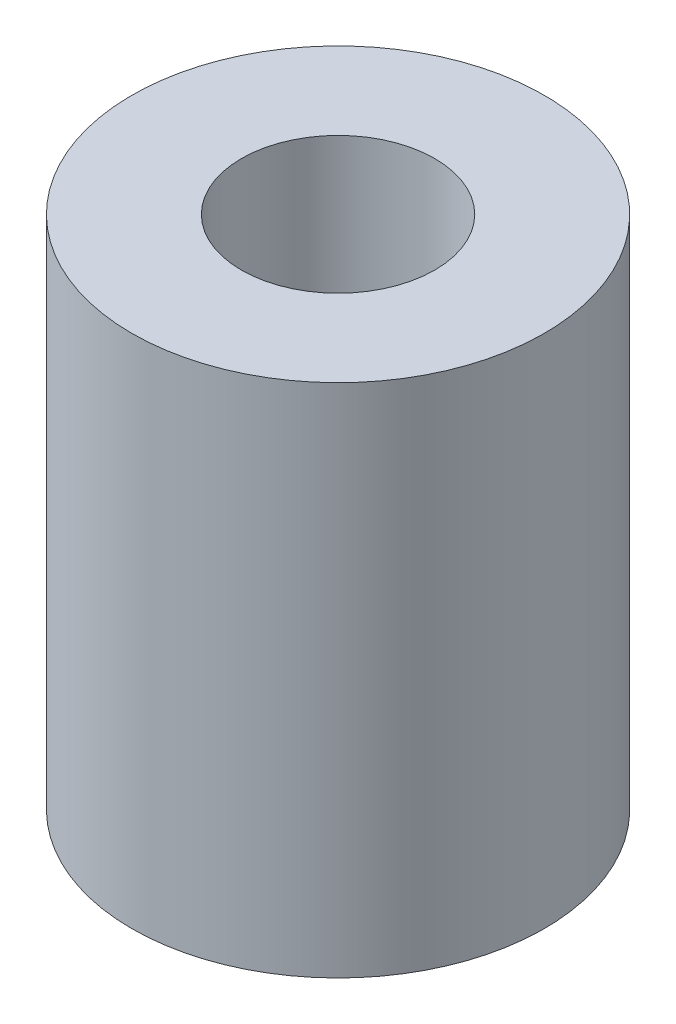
ISO-10303-21;
HEADER;
FILE_DESCRIPTION(('STEP AP214'),'2;1');
FILE_NAME('part.step','',(''),(''),'','','');
FILE_SCHEMA(('AUTOMOTIVE_DESIGN { 1 0 10303 214 1 1 1 1 }'));
ENDSEC;
DATA;
#1=APPLICATION_CONTEXT('core data for automotive mechanical design processes');
#2=APPLICATION_PROTOCOL_DEFINITION('international standard','automotive_design',2000,#1);
#3=PRODUCT_CONTEXT('',#1,'mechanical');
#4=PRODUCT('Part','Part','',(#3));
#5=PRODUCT_RELATED_PRODUCT_CATEGORY('part','',(#4));
#6=PRODUCT_DEFINITION_FORMATION('','',#4);
#7=PRODUCT_DEFINITION_CONTEXT('part definition',#1,'design');
#8=PRODUCT_DEFINITION('design','',#6,#7);
#9=PRODUCT_DEFINITION_SHAPE('','',#8);
#10=(LENGTH_UNIT() NAMED_UNIT(*) SI_UNIT(.MILLI.,.METRE.));
#11=(NAMED_UNIT(*) PLANE_ANGLE_UNIT() SI_UNIT($,.RADIAN.));
#12=(NAMED_UNIT(*) SI_UNIT($,.STERADIAN.) SOLID_ANGLE_UNIT());
#13=UNCERTAINTY_MEASURE_WITH_UNIT(LENGTH_MEASURE(1.E-05),#10,'distance_accuracy_value','');
#14=(GEOMETRIC_REPRESENTATION_CONTEXT(3) GLOBAL_UNCERTAINTY_ASSIGNED_CONTEXT((#13)) GLOBAL_UNIT_ASSIGNED_CONTEXT((#10,
#11,#12)) REPRESENTATION_CONTEXT('',''));
#15=CARTESIAN_POINT('',(0.,0.,0.));
#16=DIRECTION('',(0.,0.,1.));
#17=DIRECTION('',(1.,0.,0.));
#18=AXIS2_PLACEMENT_3D('',#15,#16,#17);
#19=CARTESIAN_POINT('',(0.,12.7,0.));
#20=DIRECTION('',(0.,1.,0.));
#21=DIRECTION('',(0.,0.,1.));
#22=AXIS2_PLACEMENT_3D('',#19,#20,#21);
#23=PLANE('',#22);
#24=CARTESIAN_POINT('',(0.,12.7,0.));
#25=DIRECTION('',(0.,1.,0.));
#26=DIRECTION('',(0.,0.,1.));
#27=AXIS2_PLACEMENT_3D('',#24,#25,#26);
#28=CIRCLE('',#27,5.08);
#29=CARTESIAN_POINT('',(0.,12.7,5.08));
#30=VERTEX_POINT('',#29);
#31=EDGE_CURVE('E10',#30,#30,#28,.T.);
#32=ORIENTED_EDGE('',*,*,#31,.T.);
#33=EDGE_LOOP('',(#32));
#34=FACE_BOUND('',#33,.T.);
#35=CARTESIAN_POINT('',(0.,12.7,0.));
#36=DIRECTION('',(0.,1.,0.));
#37=DIRECTION('',(0.,0.,1.));
#38=AXIS2_PLACEMENT_3D('',#35,#36,#37);
#39=CIRCLE('',#38,2.38125);
#40=CARTESIAN_POINT('',(0.,12.7,2.38125));
#41=VERTEX_POINT('',#40);
#42=EDGE_CURVE('E42',#41,#41,#39,.T.);
#43=ORIENTED_EDGE('',*,*,#42,.F.);
#44=EDGE_LOOP('',(#43));
#45=FACE_BOUND('',#44,.T.);
#46=ADVANCED_FACE('F31',(#34,#45),#23,.T.);
#47=CARTESIAN_POINT('',(0.,0.,0.));
#48=DIRECTION('',(0.,1.,0.));
#49=DIRECTION('',(0.,0.,1.));
#50=AXIS2_PLACEMENT_3D('',#47,#48,#49);
#51=PLANE('',#50);
#52=CARTESIAN_POINT('',(0.,0.,0.));
#53=DIRECTION('',(0.,1.,0.));
#54=DIRECTION('',(0.,0.,1.));
#55=AXIS2_PLACEMENT_3D('',#52,#53,#54);
#56=CIRCLE('',#55,5.08);
#57=CARTESIAN_POINT('',(0.,0.,5.08));
#58=VERTEX_POINT('',#57);
#59=EDGE_CURVE('E35',#58,#58,#56,.T.);
#60=ORIENTED_EDGE('',*,*,#59,.F.);
#61=EDGE_LOOP('',(#60));
#62=FACE_BOUND('',#61,.T.);
#63=CARTESIAN_POINT('',(0.,0.,0.));
#64=DIRECTION('',(0.,1.,0.));
#65=DIRECTION('',(0.,0.,1.));
#66=AXIS2_PLACEMENT_3D('',#63,#64,#65);
#67=CIRCLE('',#66,2.38125);
#68=CARTESIAN_POINT('',(0.,0.,2.38125));
#69=VERTEX_POINT('',#68);
#70=EDGE_CURVE('E44',#69,#69,#67,.T.);
#71=ORIENTED_EDGE('',*,*,#70,.T.);
#72=EDGE_LOOP('',(#71));
#73=FACE_BOUND('',#72,.T.);
#74=ADVANCED_FACE('F54',(#62,#73),#51,.F.);
#75=CARTESIAN_POINT('',(0.,12.7,0.));
#76=DIRECTION('',(0.,-1.,0.));
#77=DIRECTION('',(0.,0.,-1.));
#78=AXIS2_PLACEMENT_3D('',#75,#76,#77);
#79=CYLINDRICAL_SURFACE('',#78,5.08);
#80=ORIENTED_EDGE('',*,*,#31,.F.);
#81=EDGE_LOOP('',(#80));
#82=FACE_BOUND('',#81,.T.);
#83=ORIENTED_EDGE('',*,*,#59,.T.);
#84=EDGE_LOOP('',(#83));
#85=FACE_BOUND('',#84,.T.);
#86=ADVANCED_FACE('F33',(#82,#85),#79,.T.);
#87=CARTESIAN_POINT('',(0.,12.7,0.));
#88=DIRECTION('',(0.,-1.,0.));
#89=DIRECTION('',(0.,0.,-1.));
#90=AXIS2_PLACEMENT_3D('',#87,#88,#89);
#91=CYLINDRICAL_SURFACE('',#90,2.38125);
#92=ORIENTED_EDGE('',*,*,#42,.T.);
#93=EDGE_LOOP('',(#92));
#94=FACE_BOUND('',#93,.T.);
#95=ORIENTED_EDGE('',*,*,#70,.F.);
#96=EDGE_LOOP('',(#95));
#97=FACE_BOUND('',#96,.T.);
#98=ADVANCED_FACE('F50',(#94,#97),#91,.F.);
#99=CLOSED_SHELL('',(#46,#74,#86,#98));
#100=MANIFOLD_SOLID_BREP('B2',#99);
#101=ADVANCED_BREP_SHAPE_REPRESENTATION('',(#18,#100),#14);
#102=SHAPE_DEFINITION_REPRESENTATION(#9,#101);
ENDSEC;
END-ISO-10303-21;
